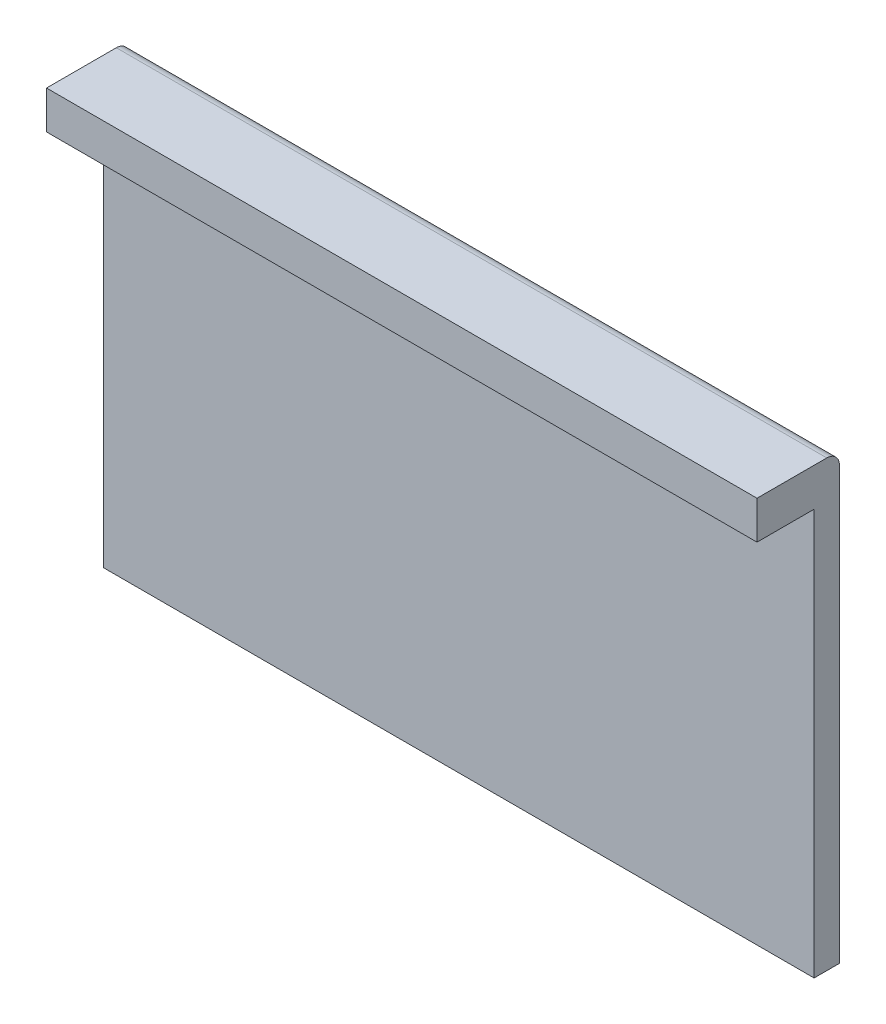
ISO-10303-21;
HEADER;
FILE_DESCRIPTION(('STEP AP214'),'2;1');
FILE_NAME('part.step','',(''),(''),'','','');
FILE_SCHEMA(('AUTOMOTIVE_DESIGN { 1 0 10303 214 1 1 1 1 }'));
ENDSEC;
DATA;
#1=APPLICATION_CONTEXT('core data for automotive mechanical design processes');
#2=APPLICATION_PROTOCOL_DEFINITION('international standard','automotive_design',2000,#1);
#3=PRODUCT_CONTEXT('',#1,'mechanical');
#4=PRODUCT('Part','Part','',(#3));
#5=PRODUCT_RELATED_PRODUCT_CATEGORY('part','',(#4));
#6=PRODUCT_DEFINITION_FORMATION('','',#4);
#7=PRODUCT_DEFINITION_CONTEXT('part definition',#1,'design');
#8=PRODUCT_DEFINITION('design','',#6,#7);
#9=PRODUCT_DEFINITION_SHAPE('','',#8);
#10=(LENGTH_UNIT() NAMED_UNIT(*) SI_UNIT(.MILLI.,.METRE.));
#11=(NAMED_UNIT(*) PLANE_ANGLE_UNIT() SI_UNIT($,.RADIAN.));
#12=(NAMED_UNIT(*) SI_UNIT($,.STERADIAN.) SOLID_ANGLE_UNIT());
#13=UNCERTAINTY_MEASURE_WITH_UNIT(LENGTH_MEASURE(1.E-05),#10,'distance_accuracy_value','');
#14=(GEOMETRIC_REPRESENTATION_CONTEXT(3) GLOBAL_UNCERTAINTY_ASSIGNED_CONTEXT((#13)) GLOBAL_UNIT_ASSIGNED_CONTEXT((#10,
#11,#12)) REPRESENTATION_CONTEXT('',''));
#15=CARTESIAN_POINT('',(0.,0.,0.));
#16=DIRECTION('',(0.,0.,1.));
#17=DIRECTION('',(1.,0.,0.));
#18=AXIS2_PLACEMENT_3D('',#15,#16,#17);
#19=CARTESIAN_POINT('',(4.,35.,2.));
#20=DIRECTION('',(0.,0.,-1.));
#21=DIRECTION('',(-1.,0.,0.));
#22=AXIS2_PLACEMENT_3D('',#19,#20,#21);
#23=PLANE('',#22);
#24=DIRECTION('',(1.,0.,0.));
#25=VECTOR('',#24,1.);
#26=CARTESIAN_POINT('',(4.,32.,2.));
#27=LINE('',#26,#25);
#28=CARTESIAN_POINT('',(4.,32.,2.));
#29=VERTEX_POINT('',#28);
#30=CARTESIAN_POINT('',(60.,32.,2.));
#31=VERTEX_POINT('',#30);
#32=EDGE_CURVE('E101',#29,#31,#27,.T.);
#33=ORIENTED_EDGE('',*,*,#32,.F.);
#34=DIRECTION('',(0.,-1.,0.));
#35=VECTOR('',#34,1.);
#36=CARTESIAN_POINT('',(4.,0.,2.));
#37=LINE('',#36,#35);
#38=CARTESIAN_POINT('',(4.,0.,2.));
#39=VERTEX_POINT('',#38);
#40=EDGE_CURVE('E173',#29,#39,#37,.T.);
#41=ORIENTED_EDGE('',*,*,#40,.T.);
#42=DIRECTION('',(1.,0.,0.));
#43=VECTOR('',#42,1.);
#44=CARTESIAN_POINT('',(4.,0.,2.));
#45=LINE('',#44,#43);
#46=CARTESIAN_POINT('',(60.,0.,2.));
#47=VERTEX_POINT('',#46);
#48=EDGE_CURVE('E104',#39,#47,#45,.T.);
#49=ORIENTED_EDGE('',*,*,#48,.T.);
#50=DIRECTION('',(0.,1.,0.));
#51=VECTOR('',#50,1.);
#52=CARTESIAN_POINT('',(60.,0.,2.));
#53=LINE('',#52,#51);
#54=EDGE_CURVE('E99',#47,#31,#53,.T.);
#55=ORIENTED_EDGE('',*,*,#54,.T.);
#56=EDGE_LOOP('',(#33,#41,#49,#55));
#57=FACE_BOUND('',#56,.T.);
#58=ADVANCED_FACE('F41',(#57),#23,.F.);
#59=CARTESIAN_POINT('',(4.,0.,2.));
#60=DIRECTION('',(1.,0.,0.));
#61=DIRECTION('',(0.,0.,-1.));
#62=AXIS2_PLACEMENT_3D('',#59,#60,#61);
#63=PLANE('',#62);
#64=DIRECTION('',(0.,0.,-1.));
#65=VECTOR('',#64,1.);
#66=CARTESIAN_POINT('',(4.,35.,2.));
#67=LINE('',#66,#65);
#68=CARTESIAN_POINT('',(4.,35.,6.5));
#69=VERTEX_POINT('',#68);
#70=CARTESIAN_POINT('',(4.,35.,1.));
#71=VERTEX_POINT('',#70);
#72=EDGE_CURVE('E110',#69,#71,#67,.T.);
#73=ORIENTED_EDGE('',*,*,#72,.T.);
#74=CARTESIAN_POINT('',(4.,34.,1.));
#75=DIRECTION('',(1.,0.,0.));
#76=DIRECTION('',(0.,0.,-1.));
#77=AXIS2_PLACEMENT_3D('',#74,#75,#76);
#78=CIRCLE('',#77,1.);
#79=CARTESIAN_POINT('',(4.,34.,0.));
#80=VERTEX_POINT('',#79);
#81=EDGE_CURVE('E64',#71,#80,#78,.F.);
#82=ORIENTED_EDGE('',*,*,#81,.T.);
#83=DIRECTION('',(0.,-1.,0.));
#84=VECTOR('',#83,1.);
#85=CARTESIAN_POINT('',(4.,0.,0.));
#86=LINE('',#85,#84);
#87=CARTESIAN_POINT('',(4.,0.,0.));
#88=VERTEX_POINT('',#87);
#89=EDGE_CURVE('E132',#80,#88,#86,.T.);
#90=ORIENTED_EDGE('',*,*,#89,.T.);
#91=DIRECTION('',(0.,0.,-1.));
#92=VECTOR('',#91,1.);
#93=CARTESIAN_POINT('',(4.,0.,2.));
#94=LINE('',#93,#92);
#95=EDGE_CURVE('E146',#39,#88,#94,.T.);
#96=ORIENTED_EDGE('',*,*,#95,.F.);
#97=ORIENTED_EDGE('',*,*,#40,.F.);
#98=DIRECTION('',(0.,0.,-1.));
#99=VECTOR('',#98,1.);
#100=CARTESIAN_POINT('',(4.,32.,6.5));
#101=LINE('',#100,#99);
#102=CARTESIAN_POINT('',(4.,32.,6.5));
#103=VERTEX_POINT('',#102);
#104=EDGE_CURVE('E119',#103,#29,#101,.T.);
#105=ORIENTED_EDGE('',*,*,#104,.F.);
#106=DIRECTION('',(0.,-1.,0.));
#107=VECTOR('',#106,1.);
#108=CARTESIAN_POINT('',(4.,35.,6.5));
#109=LINE('',#108,#107);
#110=EDGE_CURVE('E121',#69,#103,#109,.T.);
#111=ORIENTED_EDGE('',*,*,#110,.F.);
#112=EDGE_LOOP('',(#73,#82,#90,#96,#97,#105,#111));
#113=FACE_BOUND('',#112,.T.);
#114=ADVANCED_FACE('F43',(#113),#63,.F.);
#115=CARTESIAN_POINT('',(4.,0.,2.));
#116=DIRECTION('',(0.,1.,0.));
#117=DIRECTION('',(0.,0.,1.));
#118=AXIS2_PLACEMENT_3D('',#115,#116,#117);
#119=PLANE('',#118);
#120=DIRECTION('',(1.,0.,0.));
#121=VECTOR('',#120,1.);
#122=CARTESIAN_POINT('',(4.,0.,0.));
#123=LINE('',#122,#121);
#124=CARTESIAN_POINT('',(60.,0.,0.));
#125=VERTEX_POINT('',#124);
#126=EDGE_CURVE('E181',#88,#125,#123,.T.);
#127=ORIENTED_EDGE('',*,*,#126,.T.);
#128=DIRECTION('',(0.,0.,-1.));
#129=VECTOR('',#128,1.);
#130=CARTESIAN_POINT('',(60.,0.,2.));
#131=LINE('',#130,#129);
#132=EDGE_CURVE('E157',#47,#125,#131,.T.);
#133=ORIENTED_EDGE('',*,*,#132,.F.);
#134=ORIENTED_EDGE('',*,*,#48,.F.);
#135=ORIENTED_EDGE('',*,*,#95,.T.);
#136=EDGE_LOOP('',(#127,#133,#134,#135));
#137=FACE_BOUND('',#136,.T.);
#138=ADVANCED_FACE('F210',(#137),#119,.F.);
#139=CARTESIAN_POINT('',(60.,0.,2.));
#140=DIRECTION('',(-1.,0.,0.));
#141=DIRECTION('',(0.,0.,1.));
#142=AXIS2_PLACEMENT_3D('',#139,#140,#141);
#143=PLANE('',#142);
#144=DIRECTION('',(0.,1.,0.));
#145=VECTOR('',#144,1.);
#146=CARTESIAN_POINT('',(60.,0.,0.));
#147=LINE('',#146,#145);
#148=CARTESIAN_POINT('',(60.,34.,0.));
#149=VERTEX_POINT('',#148);
#150=EDGE_CURVE('E177',#125,#149,#147,.T.);
#151=ORIENTED_EDGE('',*,*,#150,.T.);
#152=CARTESIAN_POINT('',(60.,34.,1.));
#153=DIRECTION('',(-1.,0.,0.));
#154=DIRECTION('',(0.,0.,1.));
#155=AXIS2_PLACEMENT_3D('',#152,#153,#154);
#156=CIRCLE('',#155,1.);
#157=CARTESIAN_POINT('',(60.,35.,1.));
#158=VERTEX_POINT('',#157);
#159=EDGE_CURVE('E11',#149,#158,#156,.F.);
#160=ORIENTED_EDGE('',*,*,#159,.T.);
#161=DIRECTION('',(0.,0.,-1.));
#162=VECTOR('',#161,1.);
#163=CARTESIAN_POINT('',(60.,35.,2.));
#164=LINE('',#163,#162);
#165=CARTESIAN_POINT('',(60.,35.,6.5));
#166=VERTEX_POINT('',#165);
#167=EDGE_CURVE('E161',#166,#158,#164,.T.);
#168=ORIENTED_EDGE('',*,*,#167,.F.);
#169=DIRECTION('',(0.,1.,0.));
#170=VECTOR('',#169,1.);
#171=CARTESIAN_POINT('',(60.,35.,6.5));
#172=LINE('',#171,#170);
#173=CARTESIAN_POINT('',(60.,32.,6.5));
#174=VERTEX_POINT('',#173);
#175=EDGE_CURVE('E125',#174,#166,#172,.T.);
#176=ORIENTED_EDGE('',*,*,#175,.F.);
#177=DIRECTION('',(0.,0.,-1.));
#178=VECTOR('',#177,1.);
#179=CARTESIAN_POINT('',(60.,32.,6.5));
#180=LINE('',#179,#178);
#181=EDGE_CURVE('E116',#174,#31,#180,.T.);
#182=ORIENTED_EDGE('',*,*,#181,.T.);
#183=ORIENTED_EDGE('',*,*,#54,.F.);
#184=ORIENTED_EDGE('',*,*,#132,.T.);
#185=EDGE_LOOP('',(#151,#160,#168,#176,#182,#183,#184));
#186=FACE_BOUND('',#185,.T.);
#187=ADVANCED_FACE('F123',(#186),#143,.F.);
#188=CARTESIAN_POINT('',(4.,35.,2.));
#189=DIRECTION('',(0.,-1.,0.));
#190=DIRECTION('',(0.,0.,-1.));
#191=AXIS2_PLACEMENT_3D('',#188,#189,#190);
#192=PLANE('',#191);
#193=ORIENTED_EDGE('',*,*,#167,.T.);
#194=DIRECTION('',(-1.,0.,0.));
#195=VECTOR('',#194,1.);
#196=CARTESIAN_POINT('',(4.,35.,1.));
#197=LINE('',#196,#195);
#198=EDGE_CURVE('E142',#158,#71,#197,.T.);
#199=ORIENTED_EDGE('',*,*,#198,.T.);
#200=ORIENTED_EDGE('',*,*,#72,.F.);
#201=DIRECTION('',(-1.,0.,0.));
#202=VECTOR('',#201,1.);
#203=CARTESIAN_POINT('',(4.,35.,6.5));
#204=LINE('',#203,#202);
#205=EDGE_CURVE('E127',#166,#69,#204,.T.);
#206=ORIENTED_EDGE('',*,*,#205,.F.);
#207=EDGE_LOOP('',(#193,#199,#200,#206));
#208=FACE_BOUND('',#207,.T.);
#209=ADVANCED_FACE('F217',(#208),#192,.F.);
#210=CARTESIAN_POINT('',(4.,35.,0.));
#211=DIRECTION('',(0.,0.,-1.));
#212=DIRECTION('',(-1.,0.,0.));
#213=AXIS2_PLACEMENT_3D('',#210,#211,#212);
#214=PLANE('',#213);
#215=ORIENTED_EDGE('',*,*,#89,.F.);
#216=DIRECTION('',(-1.,0.,0.));
#217=VECTOR('',#216,1.);
#218=CARTESIAN_POINT('',(60.,34.,0.));
#219=LINE('',#218,#217);
#220=EDGE_CURVE('E50',#80,#149,#219,.F.);
#221=ORIENTED_EDGE('',*,*,#220,.T.);
#222=ORIENTED_EDGE('',*,*,#150,.F.);
#223=ORIENTED_EDGE('',*,*,#126,.F.);
#224=EDGE_LOOP('',(#215,#221,#222,#223));
#225=FACE_BOUND('',#224,.T.);
#226=ADVANCED_FACE('F212',(#225),#214,.T.);
#227=CARTESIAN_POINT('',(4.,32.,6.5));
#228=DIRECTION('',(0.,1.,0.));
#229=DIRECTION('',(0.,0.,1.));
#230=AXIS2_PLACEMENT_3D('',#227,#228,#229);
#231=PLANE('',#230);
#232=ORIENTED_EDGE('',*,*,#32,.T.);
#233=ORIENTED_EDGE('',*,*,#181,.F.);
#234=DIRECTION('',(1.,0.,0.));
#235=VECTOR('',#234,1.);
#236=CARTESIAN_POINT('',(4.,32.,6.5));
#237=LINE('',#236,#235);
#238=EDGE_CURVE('E198',#103,#174,#237,.T.);
#239=ORIENTED_EDGE('',*,*,#238,.F.);
#240=ORIENTED_EDGE('',*,*,#104,.T.);
#241=EDGE_LOOP('',(#232,#233,#239,#240));
#242=FACE_BOUND('',#241,.T.);
#243=ADVANCED_FACE('F115',(#242),#231,.F.);
#244=CARTESIAN_POINT('',(4.,32.,6.5));
#245=DIRECTION('',(0.,0.,1.));
#246=DIRECTION('',(1.,0.,0.));
#247=AXIS2_PLACEMENT_3D('',#244,#245,#246);
#248=PLANE('',#247);
#249=ORIENTED_EDGE('',*,*,#110,.T.);
#250=ORIENTED_EDGE('',*,*,#238,.T.);
#251=ORIENTED_EDGE('',*,*,#175,.T.);
#252=ORIENTED_EDGE('',*,*,#205,.T.);
#253=EDGE_LOOP('',(#249,#250,#251,#252));
#254=FACE_BOUND('',#253,.T.);
#255=ADVANCED_FACE('F207',(#254),#248,.T.);
#256=CARTESIAN_POINT('',(4.,34.,1.));
#257=DIRECTION('',(1.,0.,0.));
#258=DIRECTION('',(0.,0.,-1.));
#259=AXIS2_PLACEMENT_3D('',#256,#257,#258);
#260=CYLINDRICAL_SURFACE('',#259,1.);
#261=ORIENTED_EDGE('',*,*,#159,.F.);
#262=ORIENTED_EDGE('',*,*,#220,.F.);
#263=ORIENTED_EDGE('',*,*,#81,.F.);
#264=ORIENTED_EDGE('',*,*,#198,.F.);
#265=EDGE_LOOP('',(#261,#262,#263,#264));
#266=FACE_BOUND('',#265,.T.);
#267=ADVANCED_FACE('F214',(#266),#260,.T.);
#268=CLOSED_SHELL('',(#58,#114,#138,#187,#209,#226,#243,#255,#267));
#269=MANIFOLD_SOLID_BREP('B2',#268);
#270=ADVANCED_BREP_SHAPE_REPRESENTATION('',(#18,#269),#14);
#271=SHAPE_DEFINITION_REPRESENTATION(#9,#270);
ENDSEC;
END-ISO-10303-21;
